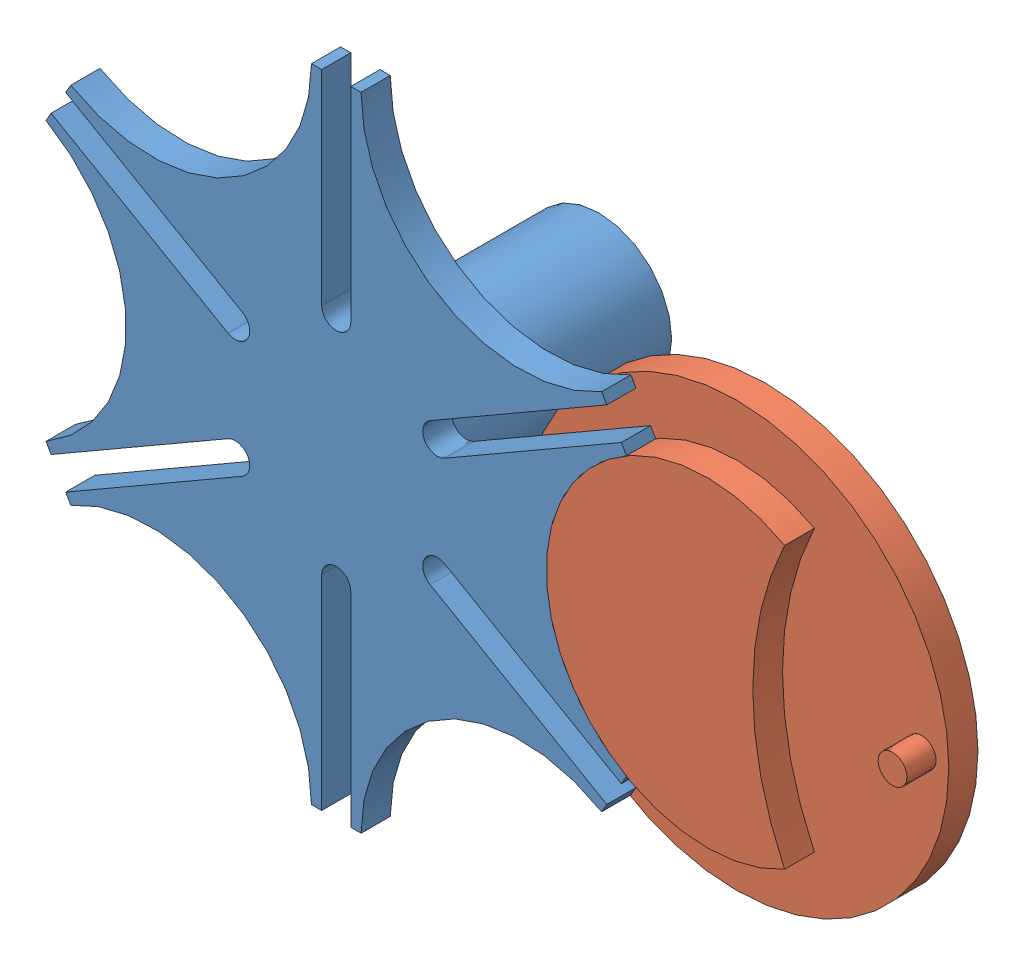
SolidWorks assembly Geneva Wheel.SLDASM, configuration Default (file format 3100). Lengths in mm.
Overall size (380.17 279.4 114.3).
2 component instances, 2 part files, 6 mates.
Components (placement in the parent):
- Output Geneva wheel-1: Output Geneva wheel.SLDPRT [Default] at origin size (252.77 279.4 114.3)
- Input Disk-1: Input Disk.SLDPRT [Default] at (161.3152 0 -0.254) size (184.93 184.93 25.65)
Mates (geometry in assembly coordinates):
- Coincident1: coincident anti-aligned: plane of Output Geneva wheel-1 through (161.3117 0 0) normal (0 0 -1); plane of assembly
- Coincident2: coincident: axis of Output Geneva wheel-1; plane of assembly
- Coincident3: coincident: axis of Output Geneva wheel-1; plane of assembly
- Coincident4: coincident aligned: plane of Output Geneva wheel-1 through (161.3117 0 12.7) normal (0 0 1); plane of Input Disk-1 through (161.3152 0 12.7) normal (0 0 1)
- Coincident5: coincident: point of Input Disk-1; plane of assembly
- Distance1: distance = 161.3154 mm: point of Input Disk-1; point of assembly
